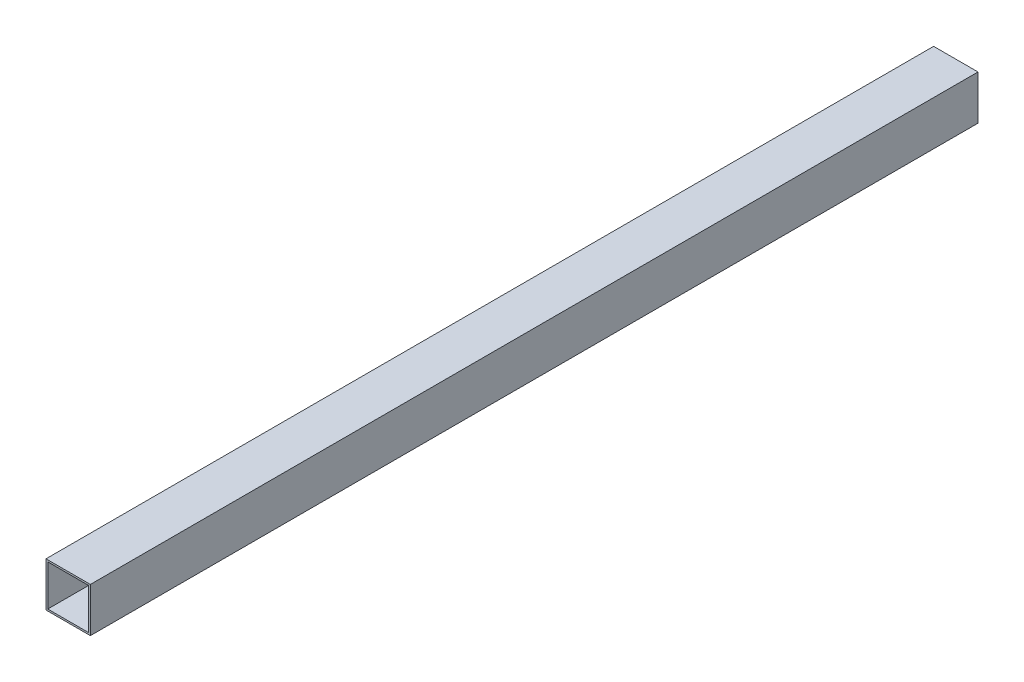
ISO-10303-21;
HEADER;
FILE_DESCRIPTION(('STEP AP214'),'2;1');
FILE_NAME('part.step','',(''),(''),'','','');
FILE_SCHEMA(('AUTOMOTIVE_DESIGN { 1 0 10303 214 1 1 1 1 }'));
ENDSEC;
DATA;
#1=APPLICATION_CONTEXT('core data for automotive mechanical design processes');
#2=APPLICATION_PROTOCOL_DEFINITION('international standard','automotive_design',2000,#1);
#3=PRODUCT_CONTEXT('',#1,'mechanical');
#4=PRODUCT('Part','Part','',(#3));
#5=PRODUCT_RELATED_PRODUCT_CATEGORY('part','',(#4));
#6=PRODUCT_DEFINITION_FORMATION('','',#4);
#7=PRODUCT_DEFINITION_CONTEXT('part definition',#1,'design');
#8=PRODUCT_DEFINITION('design','',#6,#7);
#9=PRODUCT_DEFINITION_SHAPE('','',#8);
#10=(LENGTH_UNIT() NAMED_UNIT(*) SI_UNIT(.MILLI.,.METRE.));
#11=(NAMED_UNIT(*) PLANE_ANGLE_UNIT() SI_UNIT($,.RADIAN.));
#12=(NAMED_UNIT(*) SI_UNIT($,.STERADIAN.) SOLID_ANGLE_UNIT());
#13=UNCERTAINTY_MEASURE_WITH_UNIT(LENGTH_MEASURE(1.E-05),#10,'distance_accuracy_value','');
#14=(GEOMETRIC_REPRESENTATION_CONTEXT(3) GLOBAL_UNCERTAINTY_ASSIGNED_CONTEXT((#13)) GLOBAL_UNIT_ASSIGNED_CONTEXT((#10,
#11,#12)) REPRESENTATION_CONTEXT('',''));
#15=CARTESIAN_POINT('',(0.,0.,0.));
#16=DIRECTION('',(0.,0.,1.));
#17=DIRECTION('',(1.,0.,0.));
#18=AXIS2_PLACEMENT_3D('',#15,#16,#17);
#19=CARTESIAN_POINT('',(0.,0.,600.));
#20=DIRECTION('',(0.,0.,1.));
#21=DIRECTION('',(1.,0.,0.));
#22=AXIS2_PLACEMENT_3D('',#19,#20,#21);
#23=PLANE('',#22);
#24=DIRECTION('',(0.,1.,0.));
#25=VECTOR('',#24,1.);
#26=CARTESIAN_POINT('',(15.,-15.,600.));
#27=LINE('',#26,#25);
#28=CARTESIAN_POINT('',(15.,-15.,600.));
#29=VERTEX_POINT('',#28);
#30=CARTESIAN_POINT('',(15.,15.,600.));
#31=VERTEX_POINT('',#30);
#32=EDGE_CURVE('E166',#29,#31,#27,.T.);
#33=ORIENTED_EDGE('',*,*,#32,.T.);
#34=DIRECTION('',(-1.,0.,0.));
#35=VECTOR('',#34,1.);
#36=CARTESIAN_POINT('',(-15.,15.,600.));
#37=LINE('',#36,#35);
#38=CARTESIAN_POINT('',(-15.,15.,600.));
#39=VERTEX_POINT('',#38);
#40=EDGE_CURVE('E169',#31,#39,#37,.T.);
#41=ORIENTED_EDGE('',*,*,#40,.T.);
#42=DIRECTION('',(0.,-1.,0.));
#43=VECTOR('',#42,1.);
#44=CARTESIAN_POINT('',(-15.,-15.,600.));
#45=LINE('',#44,#43);
#46=CARTESIAN_POINT('',(-15.,-15.,600.));
#47=VERTEX_POINT('',#46);
#48=EDGE_CURVE('E172',#39,#47,#45,.T.);
#49=ORIENTED_EDGE('',*,*,#48,.T.);
#50=DIRECTION('',(1.,0.,0.));
#51=VECTOR('',#50,1.);
#52=CARTESIAN_POINT('',(-15.,-15.,600.));
#53=LINE('',#52,#51);
#54=EDGE_CURVE('E174',#47,#29,#53,.T.);
#55=ORIENTED_EDGE('',*,*,#54,.T.);
#56=EDGE_LOOP('',(#33,#41,#49,#55));
#57=FACE_BOUND('',#56,.T.);
#58=DIRECTION('',(-1.,0.,0.));
#59=VECTOR('',#58,1.);
#60=CARTESIAN_POINT('',(0.,13.8,600.));
#61=LINE('',#60,#59);
#62=CARTESIAN_POINT('',(13.8,13.8,600.));
#63=VERTEX_POINT('',#62);
#64=CARTESIAN_POINT('',(-13.8,13.8,600.));
#65=VERTEX_POINT('',#64);
#66=EDGE_CURVE('E138',#63,#65,#61,.T.);
#67=ORIENTED_EDGE('',*,*,#66,.F.);
#68=DIRECTION('',(0.,1.,0.));
#69=VECTOR('',#68,1.);
#70=CARTESIAN_POINT('',(13.8,0.,600.));
#71=LINE('',#70,#69);
#72=CARTESIAN_POINT('',(13.8,-13.8,600.));
#73=VERTEX_POINT('',#72);
#74=EDGE_CURVE('E130',#73,#63,#71,.T.);
#75=ORIENTED_EDGE('',*,*,#74,.F.);
#76=DIRECTION('',(1.,0.,0.));
#77=VECTOR('',#76,1.);
#78=CARTESIAN_POINT('',(0.,-13.8,600.));
#79=LINE('',#78,#77);
#80=CARTESIAN_POINT('',(-13.8,-13.8,600.));
#81=VERTEX_POINT('',#80);
#82=EDGE_CURVE('E152',#81,#73,#79,.T.);
#83=ORIENTED_EDGE('',*,*,#82,.F.);
#84=DIRECTION('',(0.,-1.,0.));
#85=VECTOR('',#84,1.);
#86=CARTESIAN_POINT('',(-13.8,0.,600.));
#87=LINE('',#86,#85);
#88=EDGE_CURVE('E150',#65,#81,#87,.T.);
#89=ORIENTED_EDGE('',*,*,#88,.F.);
#90=EDGE_LOOP('',(#67,#75,#83,#89));
#91=FACE_BOUND('',#90,.T.);
#92=ADVANCED_FACE('F65',(#57,#91),#23,.T.);
#93=CARTESIAN_POINT('',(0.,0.,0.));
#94=DIRECTION('',(0.,0.,1.));
#95=DIRECTION('',(1.,0.,0.));
#96=AXIS2_PLACEMENT_3D('',#93,#94,#95);
#97=PLANE('',#96);
#98=DIRECTION('',(0.,1.,0.));
#99=VECTOR('',#98,1.);
#100=CARTESIAN_POINT('',(15.,-15.,0.));
#101=LINE('',#100,#99);
#102=CARTESIAN_POINT('',(15.,-15.,0.));
#103=VERTEX_POINT('',#102);
#104=CARTESIAN_POINT('',(15.,15.,0.));
#105=VERTEX_POINT('',#104);
#106=EDGE_CURVE('E146',#103,#105,#101,.T.);
#107=ORIENTED_EDGE('',*,*,#106,.F.);
#108=DIRECTION('',(1.,0.,0.));
#109=VECTOR('',#108,1.);
#110=CARTESIAN_POINT('',(-15.,-15.,0.));
#111=LINE('',#110,#109);
#112=CARTESIAN_POINT('',(-15.,-15.,0.));
#113=VERTEX_POINT('',#112);
#114=EDGE_CURVE('E170',#113,#103,#111,.T.);
#115=ORIENTED_EDGE('',*,*,#114,.F.);
#116=DIRECTION('',(0.,-1.,0.));
#117=VECTOR('',#116,1.);
#118=CARTESIAN_POINT('',(-15.,-15.,0.));
#119=LINE('',#118,#117);
#120=CARTESIAN_POINT('',(-15.,15.,0.));
#121=VERTEX_POINT('',#120);
#122=EDGE_CURVE('E181',#121,#113,#119,.T.);
#123=ORIENTED_EDGE('',*,*,#122,.F.);
#124=DIRECTION('',(-1.,0.,0.));
#125=VECTOR('',#124,1.);
#126=CARTESIAN_POINT('',(-15.,15.,0.));
#127=LINE('',#126,#125);
#128=EDGE_CURVE('E179',#105,#121,#127,.T.);
#129=ORIENTED_EDGE('',*,*,#128,.F.);
#130=EDGE_LOOP('',(#107,#115,#123,#129));
#131=FACE_BOUND('',#130,.T.);
#132=DIRECTION('',(0.,1.,0.));
#133=VECTOR('',#132,1.);
#134=CARTESIAN_POINT('',(13.8,0.,0.));
#135=LINE('',#134,#133);
#136=CARTESIAN_POINT('',(13.8,-13.8,0.));
#137=VERTEX_POINT('',#136);
#138=CARTESIAN_POINT('',(13.8,13.8,0.));
#139=VERTEX_POINT('',#138);
#140=EDGE_CURVE('E88',#137,#139,#135,.T.);
#141=ORIENTED_EDGE('',*,*,#140,.T.);
#142=DIRECTION('',(-1.,0.,0.));
#143=VECTOR('',#142,1.);
#144=CARTESIAN_POINT('',(0.,13.8,0.));
#145=LINE('',#144,#143);
#146=CARTESIAN_POINT('',(-13.8,13.8,0.));
#147=VERTEX_POINT('',#146);
#148=EDGE_CURVE('E145',#139,#147,#145,.T.);
#149=ORIENTED_EDGE('',*,*,#148,.T.);
#150=DIRECTION('',(0.,-1.,0.));
#151=VECTOR('',#150,1.);
#152=CARTESIAN_POINT('',(-13.8,0.,0.));
#153=LINE('',#152,#151);
#154=CARTESIAN_POINT('',(-13.8,-13.8,0.));
#155=VERTEX_POINT('',#154);
#156=EDGE_CURVE('E158',#147,#155,#153,.T.);
#157=ORIENTED_EDGE('',*,*,#156,.T.);
#158=DIRECTION('',(1.,0.,0.));
#159=VECTOR('',#158,1.);
#160=CARTESIAN_POINT('',(0.,-13.8,0.));
#161=LINE('',#160,#159);
#162=EDGE_CURVE('E139',#155,#137,#161,.T.);
#163=ORIENTED_EDGE('',*,*,#162,.T.);
#164=EDGE_LOOP('',(#141,#149,#157,#163));
#165=FACE_BOUND('',#164,.T.);
#166=ADVANCED_FACE('F199',(#131,#165),#97,.F.);
#167=CARTESIAN_POINT('',(15.,-15.,600.));
#168=DIRECTION('',(-1.,0.,0.));
#169=DIRECTION('',(0.,0.,1.));
#170=AXIS2_PLACEMENT_3D('',#167,#168,#169);
#171=PLANE('',#170);
#172=ORIENTED_EDGE('',*,*,#106,.T.);
#173=DIRECTION('',(0.,0.,-1.));
#174=VECTOR('',#173,1.);
#175=CARTESIAN_POINT('',(15.,15.,600.));
#176=LINE('',#175,#174);
#177=EDGE_CURVE('E12',#31,#105,#176,.T.);
#178=ORIENTED_EDGE('',*,*,#177,.F.);
#179=ORIENTED_EDGE('',*,*,#32,.F.);
#180=DIRECTION('',(0.,0.,-1.));
#181=VECTOR('',#180,1.);
#182=CARTESIAN_POINT('',(15.,-15.,600.));
#183=LINE('',#182,#181);
#184=EDGE_CURVE('E176',#29,#103,#183,.T.);
#185=ORIENTED_EDGE('',*,*,#184,.T.);
#186=EDGE_LOOP('',(#172,#178,#179,#185));
#187=FACE_BOUND('',#186,.T.);
#188=ADVANCED_FACE('F67',(#187),#171,.F.);
#189=CARTESIAN_POINT('',(-15.,15.,600.));
#190=DIRECTION('',(0.,-1.,0.));
#191=DIRECTION('',(0.,0.,-1.));
#192=AXIS2_PLACEMENT_3D('',#189,#190,#191);
#193=PLANE('',#192);
#194=ORIENTED_EDGE('',*,*,#128,.T.);
#195=DIRECTION('',(0.,0.,-1.));
#196=VECTOR('',#195,1.);
#197=CARTESIAN_POINT('',(-15.,15.,600.));
#198=LINE('',#197,#196);
#199=EDGE_CURVE('E73',#39,#121,#198,.T.);
#200=ORIENTED_EDGE('',*,*,#199,.F.);
#201=ORIENTED_EDGE('',*,*,#40,.F.);
#202=ORIENTED_EDGE('',*,*,#177,.T.);
#203=EDGE_LOOP('',(#194,#200,#201,#202));
#204=FACE_BOUND('',#203,.T.);
#205=ADVANCED_FACE('F209',(#204),#193,.F.);
#206=CARTESIAN_POINT('',(-15.,-15.,600.));
#207=DIRECTION('',(1.,0.,0.));
#208=DIRECTION('',(0.,0.,-1.));
#209=AXIS2_PLACEMENT_3D('',#206,#207,#208);
#210=PLANE('',#209);
#211=ORIENTED_EDGE('',*,*,#122,.T.);
#212=DIRECTION('',(0.,0.,-1.));
#213=VECTOR('',#212,1.);
#214=CARTESIAN_POINT('',(-15.,-15.,600.));
#215=LINE('',#214,#213);
#216=EDGE_CURVE('E186',#47,#113,#215,.T.);
#217=ORIENTED_EDGE('',*,*,#216,.F.);
#218=ORIENTED_EDGE('',*,*,#48,.F.);
#219=ORIENTED_EDGE('',*,*,#199,.T.);
#220=EDGE_LOOP('',(#211,#217,#218,#219));
#221=FACE_BOUND('',#220,.T.);
#222=ADVANCED_FACE('F193',(#221),#210,.F.);
#223=CARTESIAN_POINT('',(-15.,-15.,600.));
#224=DIRECTION('',(0.,1.,0.));
#225=DIRECTION('',(0.,0.,1.));
#226=AXIS2_PLACEMENT_3D('',#223,#224,#225);
#227=PLANE('',#226);
#228=ORIENTED_EDGE('',*,*,#114,.T.);
#229=ORIENTED_EDGE('',*,*,#184,.F.);
#230=ORIENTED_EDGE('',*,*,#54,.F.);
#231=ORIENTED_EDGE('',*,*,#216,.T.);
#232=EDGE_LOOP('',(#228,#229,#230,#231));
#233=FACE_BOUND('',#232,.T.);
#234=ADVANCED_FACE('F203',(#233),#227,.F.);
#235=CARTESIAN_POINT('',(13.8,0.,600.));
#236=DIRECTION('',(-1.,0.,0.));
#237=DIRECTION('',(0.,0.,1.));
#238=AXIS2_PLACEMENT_3D('',#235,#236,#237);
#239=PLANE('',#238);
#240=ORIENTED_EDGE('',*,*,#140,.F.);
#241=DIRECTION('',(0.,0.,-1.));
#242=VECTOR('',#241,1.);
#243=CARTESIAN_POINT('',(13.8,-13.8,600.));
#244=LINE('',#243,#242);
#245=EDGE_CURVE('E134',#73,#137,#244,.T.);
#246=ORIENTED_EDGE('',*,*,#245,.F.);
#247=ORIENTED_EDGE('',*,*,#74,.T.);
#248=DIRECTION('',(0.,0.,-1.));
#249=VECTOR('',#248,1.);
#250=CARTESIAN_POINT('',(13.8,13.8,600.));
#251=LINE('',#250,#249);
#252=EDGE_CURVE('E133',#63,#139,#251,.T.);
#253=ORIENTED_EDGE('',*,*,#252,.T.);
#254=EDGE_LOOP('',(#240,#246,#247,#253));
#255=FACE_BOUND('',#254,.T.);
#256=ADVANCED_FACE('F132',(#255),#239,.T.);
#257=CARTESIAN_POINT('',(0.,13.8,600.));
#258=DIRECTION('',(0.,-1.,0.));
#259=DIRECTION('',(0.,0.,-1.));
#260=AXIS2_PLACEMENT_3D('',#257,#258,#259);
#261=PLANE('',#260);
#262=ORIENTED_EDGE('',*,*,#148,.F.);
#263=ORIENTED_EDGE('',*,*,#252,.F.);
#264=ORIENTED_EDGE('',*,*,#66,.T.);
#265=DIRECTION('',(0.,0.,-1.));
#266=VECTOR('',#265,1.);
#267=CARTESIAN_POINT('',(-13.8,13.8,600.));
#268=LINE('',#267,#266);
#269=EDGE_CURVE('E147',#65,#147,#268,.T.);
#270=ORIENTED_EDGE('',*,*,#269,.T.);
#271=EDGE_LOOP('',(#262,#263,#264,#270));
#272=FACE_BOUND('',#271,.T.);
#273=ADVANCED_FACE('F142',(#272),#261,.T.);
#274=CARTESIAN_POINT('',(-13.8,0.,600.));
#275=DIRECTION('',(1.,0.,0.));
#276=DIRECTION('',(0.,0.,-1.));
#277=AXIS2_PLACEMENT_3D('',#274,#275,#276);
#278=PLANE('',#277);
#279=ORIENTED_EDGE('',*,*,#156,.F.);
#280=ORIENTED_EDGE('',*,*,#269,.F.);
#281=ORIENTED_EDGE('',*,*,#88,.T.);
#282=DIRECTION('',(0.,0.,-1.));
#283=VECTOR('',#282,1.);
#284=CARTESIAN_POINT('',(-13.8,-13.8,600.));
#285=LINE('',#284,#283);
#286=EDGE_CURVE('E80',#81,#155,#285,.T.);
#287=ORIENTED_EDGE('',*,*,#286,.T.);
#288=EDGE_LOOP('',(#279,#280,#281,#287));
#289=FACE_BOUND('',#288,.T.);
#290=ADVANCED_FACE('F232',(#289),#278,.T.);
#291=CARTESIAN_POINT('',(0.,-13.8,600.));
#292=DIRECTION('',(0.,1.,0.));
#293=DIRECTION('',(0.,0.,1.));
#294=AXIS2_PLACEMENT_3D('',#291,#292,#293);
#295=PLANE('',#294);
#296=ORIENTED_EDGE('',*,*,#162,.F.);
#297=ORIENTED_EDGE('',*,*,#286,.F.);
#298=ORIENTED_EDGE('',*,*,#82,.T.);
#299=ORIENTED_EDGE('',*,*,#245,.T.);
#300=EDGE_LOOP('',(#296,#297,#298,#299));
#301=FACE_BOUND('',#300,.T.);
#302=ADVANCED_FACE('F236',(#301),#295,.T.);
#303=CLOSED_SHELL('',(#92,#166,#188,#205,#222,#234,#256,#273,#290,#302));
#304=MANIFOLD_SOLID_BREP('B2',#303);
#305=ADVANCED_BREP_SHAPE_REPRESENTATION('',(#18,#304),#14);
#306=SHAPE_DEFINITION_REPRESENTATION(#9,#305);
ENDSEC;
END-ISO-10303-21;
